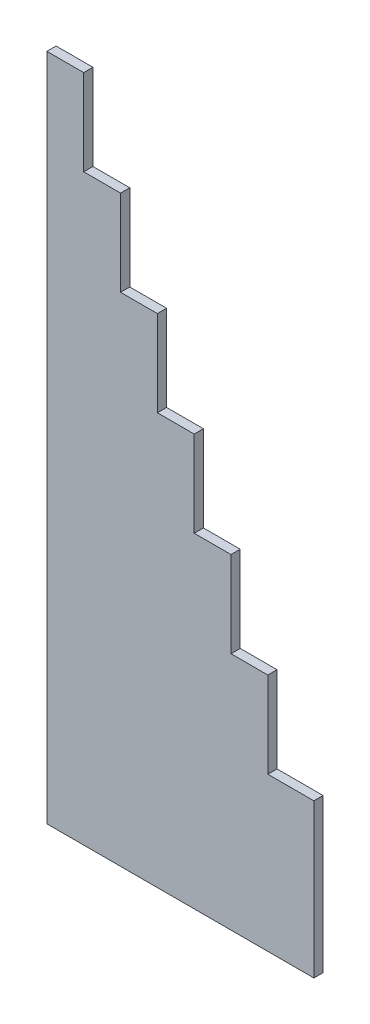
ISO-10303-21;
HEADER;
FILE_DESCRIPTION(('STEP AP214'),'2;1');
FILE_NAME('part.step','',(''),(''),'','','');
FILE_SCHEMA(('AUTOMOTIVE_DESIGN { 1 0 10303 214 1 1 1 1 }'));
ENDSEC;
DATA;
#1=APPLICATION_CONTEXT('core data for automotive mechanical design processes');
#2=APPLICATION_PROTOCOL_DEFINITION('international standard','automotive_design',2000,#1);
#3=PRODUCT_CONTEXT('',#1,'mechanical');
#4=PRODUCT('Part','Part','',(#3));
#5=PRODUCT_RELATED_PRODUCT_CATEGORY('part','',(#4));
#6=PRODUCT_DEFINITION_FORMATION('','',#4);
#7=PRODUCT_DEFINITION_CONTEXT('part definition',#1,'design');
#8=PRODUCT_DEFINITION('design','',#6,#7);
#9=PRODUCT_DEFINITION_SHAPE('','',#8);
#10=(LENGTH_UNIT() NAMED_UNIT(*) SI_UNIT(.MILLI.,.METRE.));
#11=(NAMED_UNIT(*) PLANE_ANGLE_UNIT() SI_UNIT($,.RADIAN.));
#12=(NAMED_UNIT(*) SI_UNIT($,.STERADIAN.) SOLID_ANGLE_UNIT());
#13=UNCERTAINTY_MEASURE_WITH_UNIT(LENGTH_MEASURE(1.E-05),#10,'distance_accuracy_value','');
#14=(GEOMETRIC_REPRESENTATION_CONTEXT(3) GLOBAL_UNCERTAINTY_ASSIGNED_CONTEXT((#13)) GLOBAL_UNIT_ASSIGNED_CONTEXT((#10,
#11,#12)) REPRESENTATION_CONTEXT('',''));
#15=CARTESIAN_POINT('',(0.,0.,0.));
#16=DIRECTION('',(0.,0.,1.));
#17=DIRECTION('',(1.,0.,0.));
#18=AXIS2_PLACEMENT_3D('',#15,#16,#17);
#19=CARTESIAN_POINT('',(72.0000000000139,-117.999999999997,-18.));
#20=DIRECTION('',(0.,1.,0.));
#21=DIRECTION('',(-1.,0.,0.));
#22=AXIS2_PLACEMENT_3D('',#19,#20,#21);
#23=PLANE('',#22);
#24=DIRECTION('',(-1.,0.,0.));
#25=VECTOR('',#24,1.);
#26=CARTESIAN_POINT('',(72.0000000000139,-117.999999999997,0.));
#27=LINE('',#26,#25);
#28=CARTESIAN_POINT('',(72.0000000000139,-117.999999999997,0.));
#29=VERTEX_POINT('',#28);
#30=CARTESIAN_POINT('',(1.22585146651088E-11,-117.999999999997,0.));
#31=VERTEX_POINT('',#30);
#32=EDGE_CURVE('E178',#29,#31,#27,.T.);
#33=ORIENTED_EDGE('',*,*,#32,.F.);
#34=DIRECTION('',(0.,0.,1.));
#35=VECTOR('',#34,1.);
#36=CARTESIAN_POINT('',(72.0000000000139,-117.999999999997,-18.));
#37=LINE('',#36,#35);
#38=CARTESIAN_POINT('',(72.0000000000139,-117.999999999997,-18.));
#39=VERTEX_POINT('',#38);
#40=EDGE_CURVE('E11',#39,#29,#37,.T.);
#41=ORIENTED_EDGE('',*,*,#40,.F.);
#42=DIRECTION('',(-1.,0.,0.));
#43=VECTOR('',#42,1.);
#44=CARTESIAN_POINT('',(72.0000000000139,-117.999999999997,-18.));
#45=LINE('',#44,#43);
#46=CARTESIAN_POINT('',(1.22585146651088E-11,-117.999999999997,-18.));
#47=VERTEX_POINT('',#46);
#48=EDGE_CURVE('E222',#39,#47,#45,.T.);
#49=ORIENTED_EDGE('',*,*,#48,.T.);
#50=DIRECTION('',(0.,0.,1.));
#51=VECTOR('',#50,1.);
#52=CARTESIAN_POINT('',(1.22585146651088E-11,-117.999999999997,-18.));
#53=LINE('',#52,#51);
#54=EDGE_CURVE('E36',#47,#31,#53,.T.);
#55=ORIENTED_EDGE('',*,*,#54,.T.);
#56=EDGE_LOOP('',(#33,#41,#49,#55));
#57=FACE_BOUND('',#56,.T.);
#58=ADVANCED_FACE('F33',(#57),#23,.T.);
#59=CARTESIAN_POINT('',(72.0000000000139,-285.999999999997,-18.));
#60=DIRECTION('',(1.,0.,0.));
#61=DIRECTION('',(0.,0.,-1.));
#62=AXIS2_PLACEMENT_3D('',#59,#60,#61);
#63=PLANE('',#62);
#64=DIRECTION('',(0.,1.,0.));
#65=VECTOR('',#64,1.);
#66=CARTESIAN_POINT('',(72.0000000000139,-285.999999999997,0.));
#67=LINE('',#66,#65);
#68=CARTESIAN_POINT('',(72.0000000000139,-285.999999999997,0.));
#69=VERTEX_POINT('',#68);
#70=EDGE_CURVE('E220',#69,#29,#67,.T.);
#71=ORIENTED_EDGE('',*,*,#70,.F.);
#72=DIRECTION('',(0.,0.,1.));
#73=VECTOR('',#72,1.);
#74=CARTESIAN_POINT('',(72.0000000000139,-285.999999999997,-18.));
#75=LINE('',#74,#73);
#76=CARTESIAN_POINT('',(72.0000000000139,-285.999999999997,-18.));
#77=VERTEX_POINT('',#76);
#78=EDGE_CURVE('E42',#77,#69,#75,.T.);
#79=ORIENTED_EDGE('',*,*,#78,.F.);
#80=DIRECTION('',(0.,1.,0.));
#81=VECTOR('',#80,1.);
#82=CARTESIAN_POINT('',(72.0000000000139,-285.999999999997,-18.));
#83=LINE('',#82,#81);
#84=EDGE_CURVE('E168',#77,#39,#83,.T.);
#85=ORIENTED_EDGE('',*,*,#84,.T.);
#86=ORIENTED_EDGE('',*,*,#40,.T.);
#87=EDGE_LOOP('',(#71,#79,#85,#86));
#88=FACE_BOUND('',#87,.T.);
#89=ADVANCED_FACE('F250',(#88),#63,.T.);
#90=CARTESIAN_POINT('',(144.000000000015,-285.999999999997,-18.));
#91=DIRECTION('',(0.,1.,0.));
#92=DIRECTION('',(0.,0.,1.));
#93=AXIS2_PLACEMENT_3D('',#90,#91,#92);
#94=PLANE('',#93);
#95=DIRECTION('',(-1.,0.,0.));
#96=VECTOR('',#95,1.);
#97=CARTESIAN_POINT('',(144.000000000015,-285.999999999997,0.));
#98=LINE('',#97,#96);
#99=CARTESIAN_POINT('',(144.000000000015,-285.999999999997,0.));
#100=VERTEX_POINT('',#99);
#101=EDGE_CURVE('E155',#100,#69,#98,.T.);
#102=ORIENTED_EDGE('',*,*,#101,.F.);
#103=DIRECTION('',(0.,0.,1.));
#104=VECTOR('',#103,1.);
#105=CARTESIAN_POINT('',(144.000000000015,-285.999999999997,-18.));
#106=LINE('',#105,#104);
#107=CARTESIAN_POINT('',(144.000000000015,-285.999999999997,-18.));
#108=VERTEX_POINT('',#107);
#109=EDGE_CURVE('E150',#108,#100,#106,.T.);
#110=ORIENTED_EDGE('',*,*,#109,.F.);
#111=DIRECTION('',(-1.,0.,0.));
#112=VECTOR('',#111,1.);
#113=CARTESIAN_POINT('',(144.000000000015,-285.999999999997,-18.));
#114=LINE('',#113,#112);
#115=EDGE_CURVE('E153',#108,#77,#114,.T.);
#116=ORIENTED_EDGE('',*,*,#115,.T.);
#117=ORIENTED_EDGE('',*,*,#78,.T.);
#118=EDGE_LOOP('',(#102,#110,#116,#117));
#119=FACE_BOUND('',#118,.T.);
#120=ADVANCED_FACE('F152',(#119),#94,.T.);
#121=CARTESIAN_POINT('',(144.000000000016,-453.999999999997,-18.));
#122=DIRECTION('',(1.,0.,0.));
#123=DIRECTION('',(0.,1.,0.));
#124=AXIS2_PLACEMENT_3D('',#121,#122,#123);
#125=PLANE('',#124);
#126=DIRECTION('',(0.,1.,0.));
#127=VECTOR('',#126,1.);
#128=CARTESIAN_POINT('',(144.000000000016,-453.999999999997,0.));
#129=LINE('',#128,#127);
#130=CARTESIAN_POINT('',(144.000000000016,-453.999999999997,0.));
#131=VERTEX_POINT('',#130);
#132=EDGE_CURVE('E217',#131,#100,#129,.T.);
#133=ORIENTED_EDGE('',*,*,#132,.F.);
#134=DIRECTION('',(0.,0.,1.));
#135=VECTOR('',#134,1.);
#136=CARTESIAN_POINT('',(144.000000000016,-453.999999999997,-18.));
#137=LINE('',#136,#135);
#138=CARTESIAN_POINT('',(144.000000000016,-453.999999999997,-18.));
#139=VERTEX_POINT('',#138);
#140=EDGE_CURVE('E160',#139,#131,#137,.T.);
#141=ORIENTED_EDGE('',*,*,#140,.F.);
#142=DIRECTION('',(0.,1.,0.));
#143=VECTOR('',#142,1.);
#144=CARTESIAN_POINT('',(144.000000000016,-453.999999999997,-18.));
#145=LINE('',#144,#143);
#146=EDGE_CURVE('E166',#139,#108,#145,.T.);
#147=ORIENTED_EDGE('',*,*,#146,.T.);
#148=ORIENTED_EDGE('',*,*,#109,.T.);
#149=EDGE_LOOP('',(#133,#141,#147,#148));
#150=FACE_BOUND('',#149,.T.);
#151=ADVANCED_FACE('F170',(#150),#125,.T.);
#152=CARTESIAN_POINT('',(216.000000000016,-453.999999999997,-18.));
#153=DIRECTION('',(0.,1.,0.));
#154=DIRECTION('',(0.,0.,1.));
#155=AXIS2_PLACEMENT_3D('',#152,#153,#154);
#156=PLANE('',#155);
#157=DIRECTION('',(-1.,0.,0.));
#158=VECTOR('',#157,1.);
#159=CARTESIAN_POINT('',(216.000000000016,-453.999999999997,0.));
#160=LINE('',#159,#158);
#161=CARTESIAN_POINT('',(216.000000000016,-453.999999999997,0.));
#162=VERTEX_POINT('',#161);
#163=EDGE_CURVE('E214',#162,#131,#160,.T.);
#164=ORIENTED_EDGE('',*,*,#163,.F.);
#165=DIRECTION('',(0.,0.,1.));
#166=VECTOR('',#165,1.);
#167=CARTESIAN_POINT('',(216.000000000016,-453.999999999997,-18.));
#168=LINE('',#167,#166);
#169=CARTESIAN_POINT('',(216.000000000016,-453.999999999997,-18.));
#170=VERTEX_POINT('',#169);
#171=EDGE_CURVE('E226',#170,#162,#168,.T.);
#172=ORIENTED_EDGE('',*,*,#171,.F.);
#173=DIRECTION('',(-1.,0.,0.));
#174=VECTOR('',#173,1.);
#175=CARTESIAN_POINT('',(216.000000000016,-453.999999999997,-18.));
#176=LINE('',#175,#174);
#177=EDGE_CURVE('E171',#170,#139,#176,.T.);
#178=ORIENTED_EDGE('',*,*,#177,.T.);
#179=ORIENTED_EDGE('',*,*,#140,.T.);
#180=EDGE_LOOP('',(#164,#172,#178,#179));
#181=FACE_BOUND('',#180,.T.);
#182=ADVANCED_FACE('F263',(#181),#156,.T.);
#183=CARTESIAN_POINT('',(216.000000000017,-621.999999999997,-18.));
#184=DIRECTION('',(1.,0.,0.));
#185=DIRECTION('',(0.,1.,0.));
#186=AXIS2_PLACEMENT_3D('',#183,#184,#185);
#187=PLANE('',#186);
#188=DIRECTION('',(0.,1.,0.));
#189=VECTOR('',#188,1.);
#190=CARTESIAN_POINT('',(216.000000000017,-621.999999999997,0.));
#191=LINE('',#190,#189);
#192=CARTESIAN_POINT('',(216.000000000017,-621.999999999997,0.));
#193=VERTEX_POINT('',#192);
#194=EDGE_CURVE('E211',#193,#162,#191,.T.);
#195=ORIENTED_EDGE('',*,*,#194,.F.);
#196=DIRECTION('',(0.,0.,1.));
#197=VECTOR('',#196,1.);
#198=CARTESIAN_POINT('',(216.000000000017,-621.999999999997,-18.));
#199=LINE('',#198,#197);
#200=CARTESIAN_POINT('',(216.000000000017,-621.999999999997,-18.));
#201=VERTEX_POINT('',#200);
#202=EDGE_CURVE('E228',#201,#193,#199,.T.);
#203=ORIENTED_EDGE('',*,*,#202,.F.);
#204=DIRECTION('',(0.,1.,0.));
#205=VECTOR('',#204,1.);
#206=CARTESIAN_POINT('',(216.000000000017,-621.999999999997,-18.));
#207=LINE('',#206,#205);
#208=EDGE_CURVE('E173',#201,#170,#207,.T.);
#209=ORIENTED_EDGE('',*,*,#208,.T.);
#210=ORIENTED_EDGE('',*,*,#171,.T.);
#211=EDGE_LOOP('',(#195,#203,#209,#210));
#212=FACE_BOUND('',#211,.T.);
#213=ADVANCED_FACE('F266',(#212),#187,.T.);
#214=CARTESIAN_POINT('',(288.000000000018,-621.999999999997,-18.));
#215=DIRECTION('',(0.,1.,0.));
#216=DIRECTION('',(0.,0.,1.));
#217=AXIS2_PLACEMENT_3D('',#214,#215,#216);
#218=PLANE('',#217);
#219=DIRECTION('',(-1.,0.,0.));
#220=VECTOR('',#219,1.);
#221=CARTESIAN_POINT('',(288.000000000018,-621.999999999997,0.));
#222=LINE('',#221,#220);
#223=CARTESIAN_POINT('',(288.000000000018,-621.999999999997,0.));
#224=VERTEX_POINT('',#223);
#225=EDGE_CURVE('E208',#224,#193,#222,.T.);
#226=ORIENTED_EDGE('',*,*,#225,.F.);
#227=DIRECTION('',(0.,0.,1.));
#228=VECTOR('',#227,1.);
#229=CARTESIAN_POINT('',(288.000000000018,-621.999999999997,-18.));
#230=LINE('',#229,#228);
#231=CARTESIAN_POINT('',(288.000000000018,-621.999999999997,-18.));
#232=VERTEX_POINT('',#231);
#233=EDGE_CURVE('E230',#232,#224,#230,.T.);
#234=ORIENTED_EDGE('',*,*,#233,.F.);
#235=DIRECTION('',(-1.,0.,0.));
#236=VECTOR('',#235,1.);
#237=CARTESIAN_POINT('',(288.000000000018,-621.999999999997,-18.));
#238=LINE('',#237,#236);
#239=EDGE_CURVE('E447',#232,#201,#238,.T.);
#240=ORIENTED_EDGE('',*,*,#239,.T.);
#241=ORIENTED_EDGE('',*,*,#202,.T.);
#242=EDGE_LOOP('',(#226,#234,#240,#241));
#243=FACE_BOUND('',#242,.T.);
#244=ADVANCED_FACE('F270',(#243),#218,.T.);
#245=CARTESIAN_POINT('',(288.000000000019,-789.999999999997,-18.));
#246=DIRECTION('',(1.,0.,0.));
#247=DIRECTION('',(0.,1.,0.));
#248=AXIS2_PLACEMENT_3D('',#245,#246,#247);
#249=PLANE('',#248);
#250=DIRECTION('',(0.,1.,0.));
#251=VECTOR('',#250,1.);
#252=CARTESIAN_POINT('',(288.000000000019,-789.999999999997,0.));
#253=LINE('',#252,#251);
#254=CARTESIAN_POINT('',(288.000000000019,-789.999999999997,0.));
#255=VERTEX_POINT('',#254);
#256=EDGE_CURVE('E205',#255,#224,#253,.T.);
#257=ORIENTED_EDGE('',*,*,#256,.F.);
#258=DIRECTION('',(0.,0.,1.));
#259=VECTOR('',#258,1.);
#260=CARTESIAN_POINT('',(288.000000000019,-789.999999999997,-18.));
#261=LINE('',#260,#259);
#262=CARTESIAN_POINT('',(288.000000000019,-789.999999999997,-18.));
#263=VERTEX_POINT('',#262);
#264=EDGE_CURVE('E232',#263,#255,#261,.T.);
#265=ORIENTED_EDGE('',*,*,#264,.F.);
#266=DIRECTION('',(0.,1.,0.));
#267=VECTOR('',#266,1.);
#268=CARTESIAN_POINT('',(288.000000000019,-789.999999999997,-18.));
#269=LINE('',#268,#267);
#270=EDGE_CURVE('E443',#263,#232,#269,.T.);
#271=ORIENTED_EDGE('',*,*,#270,.T.);
#272=ORIENTED_EDGE('',*,*,#233,.T.);
#273=EDGE_LOOP('',(#257,#265,#271,#272));
#274=FACE_BOUND('',#273,.T.);
#275=ADVANCED_FACE('F274',(#274),#249,.T.);
#276=CARTESIAN_POINT('',(360.00000000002,-789.999999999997,-18.));
#277=DIRECTION('',(0.,1.,0.));
#278=DIRECTION('',(0.,0.,1.));
#279=AXIS2_PLACEMENT_3D('',#276,#277,#278);
#280=PLANE('',#279);
#281=DIRECTION('',(-1.,0.,0.));
#282=VECTOR('',#281,1.);
#283=CARTESIAN_POINT('',(360.00000000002,-789.999999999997,0.));
#284=LINE('',#283,#282);
#285=CARTESIAN_POINT('',(360.00000000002,-789.999999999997,0.));
#286=VERTEX_POINT('',#285);
#287=EDGE_CURVE('E202',#286,#255,#284,.T.);
#288=ORIENTED_EDGE('',*,*,#287,.F.);
#289=DIRECTION('',(0.,0.,1.));
#290=VECTOR('',#289,1.);
#291=CARTESIAN_POINT('',(360.00000000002,-789.999999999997,-18.));
#292=LINE('',#291,#290);
#293=CARTESIAN_POINT('',(360.00000000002,-789.999999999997,-18.));
#294=VERTEX_POINT('',#293);
#295=EDGE_CURVE('E234',#294,#286,#292,.T.);
#296=ORIENTED_EDGE('',*,*,#295,.F.);
#297=DIRECTION('',(-1.,0.,0.));
#298=VECTOR('',#297,1.);
#299=CARTESIAN_POINT('',(360.00000000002,-789.999999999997,-18.));
#300=LINE('',#299,#298);
#301=EDGE_CURVE('E454',#294,#263,#300,.T.);
#302=ORIENTED_EDGE('',*,*,#301,.T.);
#303=ORIENTED_EDGE('',*,*,#264,.T.);
#304=EDGE_LOOP('',(#288,#296,#302,#303));
#305=FACE_BOUND('',#304,.T.);
#306=ADVANCED_FACE('F278',(#305),#280,.T.);
#307=CARTESIAN_POINT('',(360.000000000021,-957.999999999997,-18.));
#308=DIRECTION('',(1.,0.,0.));
#309=DIRECTION('',(0.,1.,0.));
#310=AXIS2_PLACEMENT_3D('',#307,#308,#309);
#311=PLANE('',#310);
#312=DIRECTION('',(0.,1.,0.));
#313=VECTOR('',#312,1.);
#314=CARTESIAN_POINT('',(360.000000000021,-957.999999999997,0.));
#315=LINE('',#314,#313);
#316=CARTESIAN_POINT('',(360.000000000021,-957.999999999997,0.));
#317=VERTEX_POINT('',#316);
#318=EDGE_CURVE('E199',#317,#286,#315,.T.);
#319=ORIENTED_EDGE('',*,*,#318,.F.);
#320=DIRECTION('',(0.,0.,1.));
#321=VECTOR('',#320,1.);
#322=CARTESIAN_POINT('',(360.000000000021,-957.999999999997,-18.));
#323=LINE('',#322,#321);
#324=CARTESIAN_POINT('',(360.000000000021,-957.999999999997,-18.));
#325=VERTEX_POINT('',#324);
#326=EDGE_CURVE('E236',#325,#317,#323,.T.);
#327=ORIENTED_EDGE('',*,*,#326,.F.);
#328=DIRECTION('',(0.,1.,0.));
#329=VECTOR('',#328,1.);
#330=CARTESIAN_POINT('',(360.000000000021,-957.999999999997,-18.));
#331=LINE('',#330,#329);
#332=EDGE_CURVE('E436',#325,#294,#331,.T.);
#333=ORIENTED_EDGE('',*,*,#332,.T.);
#334=ORIENTED_EDGE('',*,*,#295,.T.);
#335=EDGE_LOOP('',(#319,#327,#333,#334));
#336=FACE_BOUND('',#335,.T.);
#337=ADVANCED_FACE('F282',(#336),#311,.T.);
#338=CARTESIAN_POINT('',(432.000000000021,-957.999999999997,-18.));
#339=DIRECTION('',(0.,1.,0.));
#340=DIRECTION('',(0.,0.,1.));
#341=AXIS2_PLACEMENT_3D('',#338,#339,#340);
#342=PLANE('',#341);
#343=DIRECTION('',(-1.,0.,0.));
#344=VECTOR('',#343,1.);
#345=CARTESIAN_POINT('',(432.000000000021,-957.999999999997,0.));
#346=LINE('',#345,#344);
#347=CARTESIAN_POINT('',(432.000000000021,-957.999999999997,0.));
#348=VERTEX_POINT('',#347);
#349=EDGE_CURVE('E196',#348,#317,#346,.T.);
#350=ORIENTED_EDGE('',*,*,#349,.F.);
#351=DIRECTION('',(0.,0.,1.));
#352=VECTOR('',#351,1.);
#353=CARTESIAN_POINT('',(432.000000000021,-957.999999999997,-18.));
#354=LINE('',#353,#352);
#355=CARTESIAN_POINT('',(432.000000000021,-957.999999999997,-18.));
#356=VERTEX_POINT('',#355);
#357=EDGE_CURVE('E238',#356,#348,#354,.T.);
#358=ORIENTED_EDGE('',*,*,#357,.F.);
#359=DIRECTION('',(-1.,0.,0.));
#360=VECTOR('',#359,1.);
#361=CARTESIAN_POINT('',(432.000000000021,-957.999999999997,-18.));
#362=LINE('',#361,#360);
#363=EDGE_CURVE('E432',#356,#325,#362,.T.);
#364=ORIENTED_EDGE('',*,*,#363,.T.);
#365=ORIENTED_EDGE('',*,*,#326,.T.);
#366=EDGE_LOOP('',(#350,#358,#364,#365));
#367=FACE_BOUND('',#366,.T.);
#368=ADVANCED_FACE('F286',(#367),#342,.T.);
#369=CARTESIAN_POINT('',(432.000000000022,-1126.,-18.));
#370=DIRECTION('',(1.,0.,0.));
#371=DIRECTION('',(0.,1.,0.));
#372=AXIS2_PLACEMENT_3D('',#369,#370,#371);
#373=PLANE('',#372);
#374=DIRECTION('',(0.,1.,0.));
#375=VECTOR('',#374,1.);
#376=CARTESIAN_POINT('',(432.000000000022,-1126.,0.));
#377=LINE('',#376,#375);
#378=CARTESIAN_POINT('',(432.000000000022,-1126.,0.));
#379=VERTEX_POINT('',#378);
#380=EDGE_CURVE('E193',#379,#348,#377,.T.);
#381=ORIENTED_EDGE('',*,*,#380,.F.);
#382=DIRECTION('',(0.,0.,1.));
#383=VECTOR('',#382,1.);
#384=CARTESIAN_POINT('',(432.000000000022,-1126.,-18.));
#385=LINE('',#384,#383);
#386=CARTESIAN_POINT('',(432.000000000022,-1126.,-18.));
#387=VERTEX_POINT('',#386);
#388=EDGE_CURVE('E240',#387,#379,#385,.T.);
#389=ORIENTED_EDGE('',*,*,#388,.F.);
#390=DIRECTION('',(0.,1.,0.));
#391=VECTOR('',#390,1.);
#392=CARTESIAN_POINT('',(432.000000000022,-1126.,-18.));
#393=LINE('',#392,#391);
#394=EDGE_CURVE('E458',#387,#356,#393,.T.);
#395=ORIENTED_EDGE('',*,*,#394,.T.);
#396=ORIENTED_EDGE('',*,*,#357,.T.);
#397=EDGE_LOOP('',(#381,#389,#395,#396));
#398=FACE_BOUND('',#397,.T.);
#399=ADVANCED_FACE('F290',(#398),#373,.T.);
#400=CARTESIAN_POINT('',(522.000000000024,-1126.,-18.));
#401=DIRECTION('',(0.,1.,0.));
#402=DIRECTION('',(0.,0.,1.));
#403=AXIS2_PLACEMENT_3D('',#400,#401,#402);
#404=PLANE('',#403);
#405=DIRECTION('',(-1.,0.,0.));
#406=VECTOR('',#405,1.);
#407=CARTESIAN_POINT('',(522.000000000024,-1126.,0.));
#408=LINE('',#407,#406);
#409=CARTESIAN_POINT('',(522.000000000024,-1126.,0.));
#410=VERTEX_POINT('',#409);
#411=EDGE_CURVE('E190',#410,#379,#408,.T.);
#412=ORIENTED_EDGE('',*,*,#411,.F.);
#413=DIRECTION('',(0.,0.,1.));
#414=VECTOR('',#413,1.);
#415=CARTESIAN_POINT('',(522.000000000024,-1126.,-18.));
#416=LINE('',#415,#414);
#417=CARTESIAN_POINT('',(522.000000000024,-1126.,-18.));
#418=VERTEX_POINT('',#417);
#419=EDGE_CURVE('E242',#418,#410,#416,.T.);
#420=ORIENTED_EDGE('',*,*,#419,.F.);
#421=DIRECTION('',(-1.,0.,0.));
#422=VECTOR('',#421,1.);
#423=CARTESIAN_POINT('',(522.000000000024,-1126.,-18.));
#424=LINE('',#423,#422);
#425=EDGE_CURVE('E425',#418,#387,#424,.T.);
#426=ORIENTED_EDGE('',*,*,#425,.T.);
#427=ORIENTED_EDGE('',*,*,#388,.T.);
#428=EDGE_LOOP('',(#412,#420,#426,#427));
#429=FACE_BOUND('',#428,.T.);
#430=ADVANCED_FACE('F294',(#429),#404,.T.);
#431=CARTESIAN_POINT('',(522.000000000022,-1425.99999999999,-18.));
#432=DIRECTION('',(1.,0.,0.));
#433=DIRECTION('',(0.,1.,0.));
#434=AXIS2_PLACEMENT_3D('',#431,#432,#433);
#435=PLANE('',#434);
#436=DIRECTION('',(0.,1.,0.));
#437=VECTOR('',#436,1.);
#438=CARTESIAN_POINT('',(522.000000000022,-1425.99999999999,0.));
#439=LINE('',#438,#437);
#440=CARTESIAN_POINT('',(522.000000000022,-1425.99999999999,0.));
#441=VERTEX_POINT('',#440);
#442=EDGE_CURVE('E187',#441,#410,#439,.T.);
#443=ORIENTED_EDGE('',*,*,#442,.F.);
#444=DIRECTION('',(0.,0.,1.));
#445=VECTOR('',#444,1.);
#446=CARTESIAN_POINT('',(522.000000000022,-1425.99999999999,-18.));
#447=LINE('',#446,#445);
#448=CARTESIAN_POINT('',(522.000000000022,-1425.99999999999,-18.));
#449=VERTEX_POINT('',#448);
#450=EDGE_CURVE('E244',#449,#441,#447,.T.);
#451=ORIENTED_EDGE('',*,*,#450,.F.);
#452=DIRECTION('',(0.,1.,0.));
#453=VECTOR('',#452,1.);
#454=CARTESIAN_POINT('',(522.000000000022,-1425.99999999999,-18.));
#455=LINE('',#454,#453);
#456=EDGE_CURVE('E421',#449,#418,#455,.T.);
#457=ORIENTED_EDGE('',*,*,#456,.T.);
#458=ORIENTED_EDGE('',*,*,#419,.T.);
#459=EDGE_LOOP('',(#443,#451,#457,#458));
#460=FACE_BOUND('',#459,.T.);
#461=ADVANCED_FACE('F298',(#460),#435,.T.);
#462=CARTESIAN_POINT('',(0.,-1426.,-18.));
#463=DIRECTION('',(0.,-1.,0.));
#464=DIRECTION('',(1.,0.,0.));
#465=AXIS2_PLACEMENT_3D('',#462,#463,#464);
#466=PLANE('',#465);
#467=DIRECTION('',(1.,0.,0.));
#468=VECTOR('',#467,1.);
#469=CARTESIAN_POINT('',(0.,-1426.,0.));
#470=LINE('',#469,#468);
#471=CARTESIAN_POINT('',(0.,-1426.,0.));
#472=VERTEX_POINT('',#471);
#473=EDGE_CURVE('E184',#472,#441,#470,.T.);
#474=ORIENTED_EDGE('',*,*,#473,.F.);
#475=DIRECTION('',(0.,0.,1.));
#476=VECTOR('',#475,1.);
#477=CARTESIAN_POINT('',(0.,-1426.,-18.));
#478=LINE('',#477,#476);
#479=CARTESIAN_POINT('',(0.,-1426.,-18.));
#480=VERTEX_POINT('',#479);
#481=EDGE_CURVE('E245',#480,#472,#478,.T.);
#482=ORIENTED_EDGE('',*,*,#481,.F.);
#483=DIRECTION('',(1.,0.,0.));
#484=VECTOR('',#483,1.);
#485=CARTESIAN_POINT('',(0.,-1426.,-18.));
#486=LINE('',#485,#484);
#487=EDGE_CURVE('E462',#480,#449,#486,.T.);
#488=ORIENTED_EDGE('',*,*,#487,.T.);
#489=ORIENTED_EDGE('',*,*,#450,.T.);
#490=EDGE_LOOP('',(#474,#482,#488,#489));
#491=FACE_BOUND('',#490,.T.);
#492=ADVANCED_FACE('F302',(#491),#466,.T.);
#493=CARTESIAN_POINT('',(1.22585146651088E-11,-117.999999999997,-18.));
#494=DIRECTION('',(-1.,0.,0.));
#495=DIRECTION('',(0.,-1.,0.));
#496=AXIS2_PLACEMENT_3D('',#493,#494,#495);
#497=PLANE('',#496);
#498=DIRECTION('',(0.,-1.,0.));
#499=VECTOR('',#498,1.);
#500=CARTESIAN_POINT('',(1.22585146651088E-11,-117.999999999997,0.));
#501=LINE('',#500,#499);
#502=EDGE_CURVE('E181',#31,#472,#501,.T.);
#503=ORIENTED_EDGE('',*,*,#502,.F.);
#504=ORIENTED_EDGE('',*,*,#54,.F.);
#505=DIRECTION('',(0.,-1.,0.));
#506=VECTOR('',#505,1.);
#507=CARTESIAN_POINT('',(1.22585146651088E-11,-117.999999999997,-18.));
#508=LINE('',#507,#506);
#509=EDGE_CURVE('E464',#47,#480,#508,.T.);
#510=ORIENTED_EDGE('',*,*,#509,.T.);
#511=ORIENTED_EDGE('',*,*,#481,.T.);
#512=EDGE_LOOP('',(#503,#504,#510,#511));
#513=FACE_BOUND('',#512,.T.);
#514=ADVANCED_FACE('F247',(#513),#497,.T.);
#515=CARTESIAN_POINT('',(0.,0.,-18.));
#516=DIRECTION('',(0.,0.,1.));
#517=DIRECTION('',(1.,0.,0.));
#518=AXIS2_PLACEMENT_3D('',#515,#516,#517);
#519=PLANE('',#518);
#520=ORIENTED_EDGE('',*,*,#48,.F.);
#521=ORIENTED_EDGE('',*,*,#84,.F.);
#522=ORIENTED_EDGE('',*,*,#115,.F.);
#523=ORIENTED_EDGE('',*,*,#146,.F.);
#524=ORIENTED_EDGE('',*,*,#177,.F.);
#525=ORIENTED_EDGE('',*,*,#208,.F.);
#526=ORIENTED_EDGE('',*,*,#239,.F.);
#527=ORIENTED_EDGE('',*,*,#270,.F.);
#528=ORIENTED_EDGE('',*,*,#301,.F.);
#529=ORIENTED_EDGE('',*,*,#332,.F.);
#530=ORIENTED_EDGE('',*,*,#363,.F.);
#531=ORIENTED_EDGE('',*,*,#394,.F.);
#532=ORIENTED_EDGE('',*,*,#425,.F.);
#533=ORIENTED_EDGE('',*,*,#456,.F.);
#534=ORIENTED_EDGE('',*,*,#487,.F.);
#535=ORIENTED_EDGE('',*,*,#509,.F.);
#536=EDGE_LOOP('',(#520,#521,#522,#523,#524,#525,#526,#527,#528,#529,#530,#531,#532,#533,#534,#535));
#537=FACE_BOUND('',#536,.T.);
#538=ADVANCED_FACE('F164',(#537),#519,.F.);
#539=CARTESIAN_POINT('',(0.,0.,0.));
#540=DIRECTION('',(0.,0.,1.));
#541=DIRECTION('',(1.,0.,0.));
#542=AXIS2_PLACEMENT_3D('',#539,#540,#541);
#543=PLANE('',#542);
#544=ORIENTED_EDGE('',*,*,#32,.T.);
#545=ORIENTED_EDGE('',*,*,#502,.T.);
#546=ORIENTED_EDGE('',*,*,#473,.T.);
#547=ORIENTED_EDGE('',*,*,#442,.T.);
#548=ORIENTED_EDGE('',*,*,#411,.T.);
#549=ORIENTED_EDGE('',*,*,#380,.T.);
#550=ORIENTED_EDGE('',*,*,#349,.T.);
#551=ORIENTED_EDGE('',*,*,#318,.T.);
#552=ORIENTED_EDGE('',*,*,#287,.T.);
#553=ORIENTED_EDGE('',*,*,#256,.T.);
#554=ORIENTED_EDGE('',*,*,#225,.T.);
#555=ORIENTED_EDGE('',*,*,#194,.T.);
#556=ORIENTED_EDGE('',*,*,#163,.T.);
#557=ORIENTED_EDGE('',*,*,#132,.T.);
#558=ORIENTED_EDGE('',*,*,#101,.T.);
#559=ORIENTED_EDGE('',*,*,#70,.T.);
#560=EDGE_LOOP('',(#544,#545,#546,#547,#548,#549,#550,#551,#552,#553,#554,#555,#556,#557,#558,#559));
#561=FACE_BOUND('',#560,.T.);
#562=ADVANCED_FACE('F249',(#561),#543,.T.);
#563=CLOSED_SHELL('',(#58,#89,#120,#151,#182,#213,#244,#275,#306,#337,#368,#399,#430,#461,#492,
#514,#538,#562));
#564=MANIFOLD_SOLID_BREP('B2',#563);
#565=ADVANCED_BREP_SHAPE_REPRESENTATION('',(#18,#564),#14);
#566=SHAPE_DEFINITION_REPRESENTATION(#9,#565);
ENDSEC;
END-ISO-10303-21;
